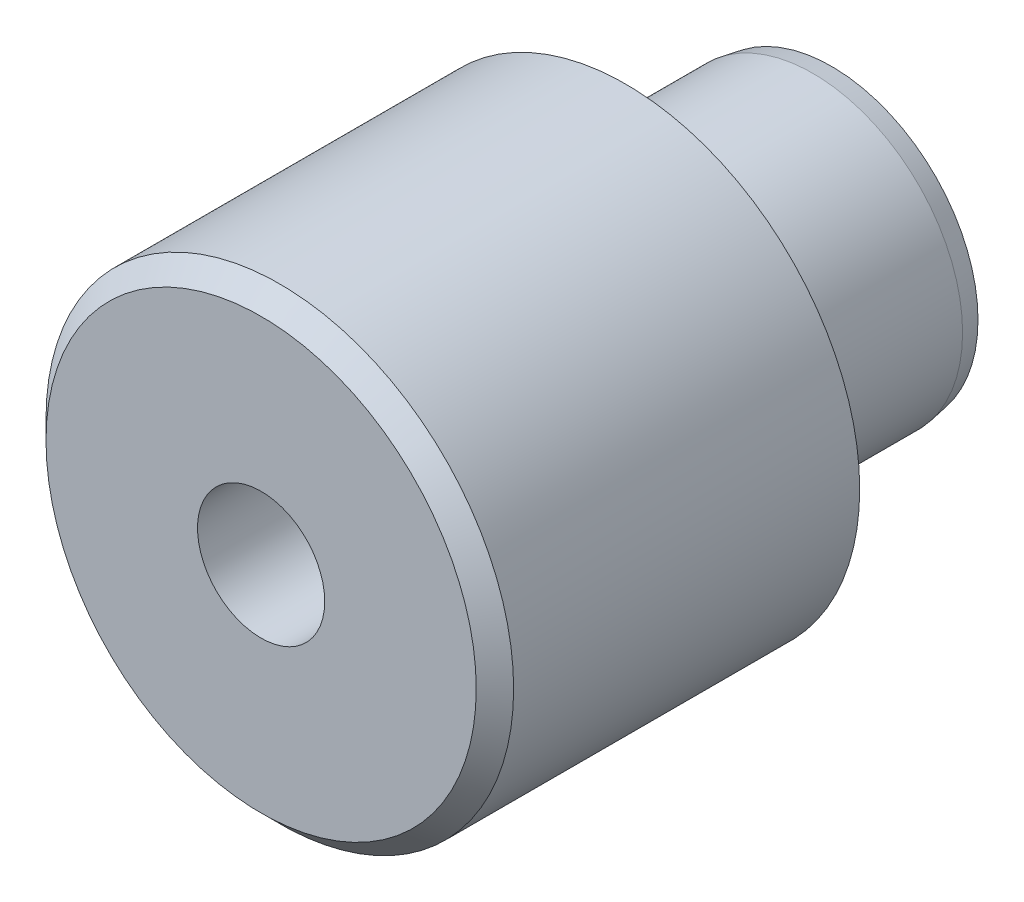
ISO-10303-21;
HEADER;
FILE_DESCRIPTION(('STEP AP214'),'2;1');
FILE_NAME('part.step','',(''),(''),'','','');
FILE_SCHEMA(('AUTOMOTIVE_DESIGN { 1 0 10303 214 1 1 1 1 }'));
ENDSEC;
DATA;
#1=APPLICATION_CONTEXT('core data for automotive mechanical design processes');
#2=APPLICATION_PROTOCOL_DEFINITION('international standard','automotive_design',2000,#1);
#3=PRODUCT_CONTEXT('',#1,'mechanical');
#4=PRODUCT('Part','Part','',(#3));
#5=PRODUCT_RELATED_PRODUCT_CATEGORY('part','',(#4));
#6=PRODUCT_DEFINITION_FORMATION('','',#4);
#7=PRODUCT_DEFINITION_CONTEXT('part definition',#1,'design');
#8=PRODUCT_DEFINITION('design','',#6,#7);
#9=PRODUCT_DEFINITION_SHAPE('','',#8);
#10=(LENGTH_UNIT() NAMED_UNIT(*) SI_UNIT(.MILLI.,.METRE.));
#11=(NAMED_UNIT(*) PLANE_ANGLE_UNIT() SI_UNIT($,.RADIAN.));
#12=(NAMED_UNIT(*) SI_UNIT($,.STERADIAN.) SOLID_ANGLE_UNIT());
#13=UNCERTAINTY_MEASURE_WITH_UNIT(LENGTH_MEASURE(1.E-05),#10,'distance_accuracy_value','');
#14=(GEOMETRIC_REPRESENTATION_CONTEXT(3) GLOBAL_UNCERTAINTY_ASSIGNED_CONTEXT((#13)) GLOBAL_UNIT_ASSIGNED_CONTEXT((#10,
#11,#12)) REPRESENTATION_CONTEXT('',''));
#15=CARTESIAN_POINT('',(0.,0.,0.));
#16=DIRECTION('',(0.,0.,1.));
#17=DIRECTION('',(1.,0.,0.));
#18=AXIS2_PLACEMENT_3D('',#15,#16,#17);
#19=CARTESIAN_POINT('',(0.,0.,0.5));
#20=DIRECTION('',(0.,0.,-1.));
#21=DIRECTION('',(-1.,0.,0.));
#22=AXIS2_PLACEMENT_3D('',#19,#20,#21);
#23=PLANE('',#22);
#24=CARTESIAN_POINT('',(0.,0.,0.5));
#25=DIRECTION('',(0.,0.,-1.));
#26=DIRECTION('',(-1.,0.,0.));
#27=AXIS2_PLACEMENT_3D('',#24,#25,#26);
#28=CIRCLE('',#27,8.8);
#29=CARTESIAN_POINT('',(-8.8,0.,0.500000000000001));
#30=VERTEX_POINT('',#29);
#31=EDGE_CURVE('E73',#30,#30,#28,.F.);
#32=ORIENTED_EDGE('',*,*,#31,.T.);
#33=EDGE_LOOP('',(#32));
#34=FACE_BOUND('',#33,.T.);
#35=CARTESIAN_POINT('',(0.,0.,0.499999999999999));
#36=DIRECTION('',(0.,0.,1.));
#37=DIRECTION('',(1.,0.,0.));
#38=AXIS2_PLACEMENT_3D('',#35,#36,#37);
#39=CIRCLE('',#38,12.5);
#40=CARTESIAN_POINT('',(12.5,0.,0.499999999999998));
#41=VERTEX_POINT('',#40);
#42=EDGE_CURVE('E70',#41,#41,#39,.T.);
#43=ORIENTED_EDGE('',*,*,#42,.F.);
#44=EDGE_LOOP('',(#43));
#45=FACE_BOUND('',#44,.T.);
#46=ADVANCED_FACE('F39',(#34,#45),#23,.T.);
#47=CARTESIAN_POINT('',(0.,0.,0.5));
#48=DIRECTION('',(0.,0.,1.));
#49=DIRECTION('',(1.,0.,0.));
#50=AXIS2_PLACEMENT_3D('',#47,#48,#49);
#51=CYLINDRICAL_SURFACE('',#50,12.5);
#52=CARTESIAN_POINT('',(0.,0.,19.));
#53=DIRECTION('',(0.,0.,1.));
#54=DIRECTION('',(1.,0.,0.));
#55=AXIS2_PLACEMENT_3D('',#52,#53,#54);
#56=CIRCLE('',#55,12.5);
#57=CARTESIAN_POINT('',(12.5,0.,19.));
#58=VERTEX_POINT('',#57);
#59=EDGE_CURVE('E11',#58,#58,#56,.F.);
#60=ORIENTED_EDGE('',*,*,#59,.T.);
#61=EDGE_LOOP('',(#60));
#62=FACE_BOUND('',#61,.T.);
#63=ORIENTED_EDGE('',*,*,#42,.T.);
#64=EDGE_LOOP('',(#63));
#65=FACE_BOUND('',#64,.T.);
#66=ADVANCED_FACE('F93',(#62,#65),#51,.T.);
#67=CARTESIAN_POINT('',(0.,0.,20.));
#68=DIRECTION('',(0.,0.,1.));
#69=DIRECTION('',(1.,0.,0.));
#70=AXIS2_PLACEMENT_3D('',#67,#68,#69);
#71=PLANE('',#70);
#72=CARTESIAN_POINT('',(0.,0.,20.));
#73=DIRECTION('',(0.,0.,1.));
#74=DIRECTION('',(1.,0.,0.));
#75=AXIS2_PLACEMENT_3D('',#72,#73,#74);
#76=CIRCLE('',#75,11.5);
#77=CARTESIAN_POINT('',(11.5,0.,20.));
#78=VERTEX_POINT('',#77);
#79=EDGE_CURVE('E46',#78,#78,#76,.T.);
#80=ORIENTED_EDGE('',*,*,#79,.T.);
#81=EDGE_LOOP('',(#80));
#82=FACE_BOUND('',#81,.T.);
#83=CARTESIAN_POINT('',(0.,0.,20.));
#84=DIRECTION('',(0.,0.,1.));
#85=DIRECTION('',(1.,0.,0.));
#86=AXIS2_PLACEMENT_3D('',#83,#84,#85);
#87=CIRCLE('',#86,3.4);
#88=CARTESIAN_POINT('',(3.4,0.,20.));
#89=VERTEX_POINT('',#88);
#90=EDGE_CURVE('E60',#89,#89,#87,.T.);
#91=ORIENTED_EDGE('',*,*,#90,.F.);
#92=EDGE_LOOP('',(#91));
#93=FACE_BOUND('',#92,.T.);
#94=ADVANCED_FACE('F81',(#82,#93),#71,.T.);
#95=CARTESIAN_POINT('',(0.,0.,-10.5));
#96=DIRECTION('',(0.,0.,1.));
#97=DIRECTION('',(1.,0.,0.));
#98=AXIS2_PLACEMENT_3D('',#95,#96,#97);
#99=CYLINDRICAL_SURFACE('',#98,8.);
#100=CARTESIAN_POINT('',(0.,0.,-0.3));
#101=DIRECTION('',(0.,0.,-1.));
#102=DIRECTION('',(-1.,0.,0.));
#103=AXIS2_PLACEMENT_3D('',#100,#101,#102);
#104=CIRCLE('',#103,8.);
#105=CARTESIAN_POINT('',(-8.,0.,-0.299999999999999));
#106=VERTEX_POINT('',#105);
#107=EDGE_CURVE('E76',#106,#106,#104,.T.);
#108=ORIENTED_EDGE('',*,*,#107,.T.);
#109=EDGE_LOOP('',(#108));
#110=FACE_BOUND('',#109,.T.);
#111=CARTESIAN_POINT('',(0.,0.,-9.5));
#112=DIRECTION('',(0.,0.,1.));
#113=DIRECTION('',(1.,0.,0.));
#114=AXIS2_PLACEMENT_3D('',#111,#112,#113);
#115=CIRCLE('',#114,8.);
#116=CARTESIAN_POINT('',(8.,0.,-9.5));
#117=VERTEX_POINT('',#116);
#118=EDGE_CURVE('E63',#117,#117,#115,.T.);
#119=ORIENTED_EDGE('',*,*,#118,.T.);
#120=EDGE_LOOP('',(#119));
#121=FACE_BOUND('',#120,.T.);
#122=ADVANCED_FACE('F105',(#110,#121),#99,.T.);
#123=CARTESIAN_POINT('',(0.,0.,-9.5));
#124=DIRECTION('',(0.,0.,1.));
#125=DIRECTION('',(1.,0.,0.));
#126=AXIS2_PLACEMENT_3D('',#123,#124,#125);
#127=CONICAL_SURFACE('',#126,8.,0.174532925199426);
#128=CARTESIAN_POINT('',(0.,0.,-10.5));
#129=DIRECTION('',(0.,0.,1.));
#130=DIRECTION('',(1.,0.,0.));
#131=AXIS2_PLACEMENT_3D('',#128,#129,#130);
#132=CIRCLE('',#131,7.82367301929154);
#133=CARTESIAN_POINT('',(7.82367301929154,0.,-10.5));
#134=VERTEX_POINT('',#133);
#135=EDGE_CURVE('E59',#134,#134,#132,.T.);
#136=ORIENTED_EDGE('',*,*,#135,.T.);
#137=EDGE_LOOP('',(#136));
#138=FACE_BOUND('',#137,.T.);
#139=ORIENTED_EDGE('',*,*,#118,.F.);
#140=EDGE_LOOP('',(#139));
#141=FACE_BOUND('',#140,.T.);
#142=ADVANCED_FACE('F108',(#138,#141),#127,.T.);
#143=CARTESIAN_POINT('',(0.,0.,-10.5));
#144=DIRECTION('',(0.,0.,-1.));
#145=DIRECTION('',(-1.,0.,0.));
#146=AXIS2_PLACEMENT_3D('',#143,#144,#145);
#147=PLANE('',#146);
#148=ORIENTED_EDGE('',*,*,#135,.F.);
#149=EDGE_LOOP('',(#148));
#150=FACE_BOUND('',#149,.T.);
#151=ADVANCED_FACE('F53',(#150),#147,.T.);
#152=CARTESIAN_POINT('',(0.,0.,0.999999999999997));
#153=DIRECTION('',(0.,0.,1.));
#154=DIRECTION('',(1.,0.,0.));
#155=AXIS2_PLACEMENT_3D('',#152,#153,#154);
#156=CONICAL_SURFACE('',#155,3.4,1.02974425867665);
#157=CARTESIAN_POINT('',(0.,0.,-1.04292610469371));
#158=VERTEX_POINT('',#157);
#159=VERTEX_LOOP('',#158);
#160=FACE_BOUND('',#159,.T.);
#161=CARTESIAN_POINT('',(0.,0.,0.999999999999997));
#162=DIRECTION('',(0.,0.,1.));
#163=DIRECTION('',(1.,0.,0.));
#164=AXIS2_PLACEMENT_3D('',#161,#162,#163);
#165=CIRCLE('',#164,3.4);
#166=CARTESIAN_POINT('',(3.39999999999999,0.,0.999999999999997));
#167=VERTEX_POINT('',#166);
#168=EDGE_CURVE('E57',#167,#167,#165,.T.);
#169=ORIENTED_EDGE('',*,*,#168,.T.);
#170=EDGE_LOOP('',(#169));
#171=FACE_BOUND('',#170,.T.);
#172=ADVANCED_FACE('F49',(#160,#171),#156,.F.);
#173=CARTESIAN_POINT('',(0.,0.,20.));
#174=DIRECTION('',(0.,0.,1.));
#175=DIRECTION('',(1.,0.,0.));
#176=AXIS2_PLACEMENT_3D('',#173,#174,#175);
#177=CYLINDRICAL_SURFACE('',#176,3.4);
#178=ORIENTED_EDGE('',*,*,#168,.F.);
#179=EDGE_LOOP('',(#178));
#180=FACE_BOUND('',#179,.T.);
#181=ORIENTED_EDGE('',*,*,#90,.T.);
#182=EDGE_LOOP('',(#181));
#183=FACE_BOUND('',#182,.T.);
#184=ADVANCED_FACE('F52',(#180,#183),#177,.F.);
#185=CARTESIAN_POINT('',(0.,0.,-0.3));
#186=DIRECTION('',(0.,0.,-1.));
#187=DIRECTION('',(-1.,0.,0.));
#188=AXIS2_PLACEMENT_3D('',#185,#186,#187);
#189=TOROIDAL_SURFACE('',#188,8.8,0.8);
#190=ORIENTED_EDGE('',*,*,#107,.F.);
#191=EDGE_LOOP('',(#190));
#192=FACE_BOUND('',#191,.T.);
#193=ORIENTED_EDGE('',*,*,#31,.F.);
#194=EDGE_LOOP('',(#193));
#195=FACE_BOUND('',#194,.T.);
#196=ADVANCED_FACE('F85',(#192,#195),#189,.F.);
#197=CARTESIAN_POINT('',(0.,0.,20.));
#198=DIRECTION('',(0.,0.,-1.));
#199=DIRECTION('',(-1.,0.,0.));
#200=AXIS2_PLACEMENT_3D('',#197,#198,#199);
#201=CONICAL_SURFACE('',#200,11.5,0.785398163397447);
#202=ORIENTED_EDGE('',*,*,#59,.F.);
#203=EDGE_LOOP('',(#202));
#204=FACE_BOUND('',#203,.T.);
#205=ORIENTED_EDGE('',*,*,#79,.F.);
#206=EDGE_LOOP('',(#205));
#207=FACE_BOUND('',#206,.T.);
#208=ADVANCED_FACE('F41',(#204,#207),#201,.T.);
#209=CLOSED_SHELL('',(#46,#66,#94,#122,#142,#151,#172,#184,#196,#208));
#210=MANIFOLD_SOLID_BREP('B2',#209);
#211=ADVANCED_BREP_SHAPE_REPRESENTATION('',(#18,#210),#14);
#212=SHAPE_DEFINITION_REPRESENTATION(#9,#211);
ENDSEC;
END-ISO-10303-21;
